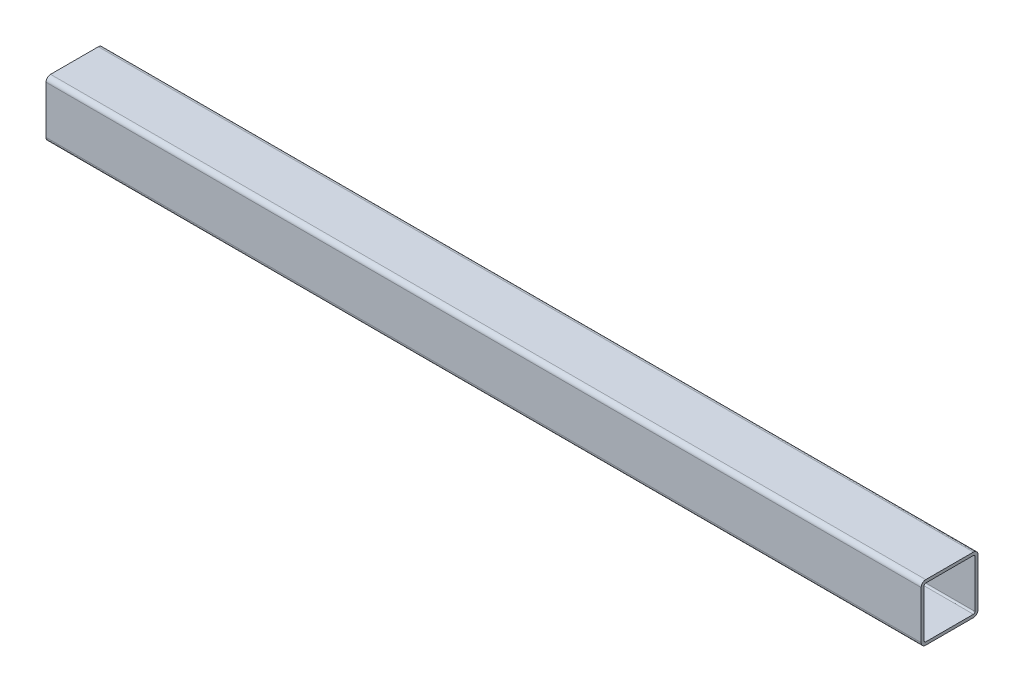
from build123d import *

# Parameters (mm, degrees)
BOSS_EXTRUDE1_DEPTH = 488.95


with BuildPart() as part:
    # Sketch1 → Boss-Extrude1 (new body)
    with BuildSketch(Plane(origin=(0, 0, 0), x_dir=(0, 0, -1), z_dir=(1, 0, 0))):
        with BuildLine():
            Line((0, 2.54), (0, 29.21))
            ThreePointArc((0, 29.21), (-0.743948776, 31.006051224), (-2.54, 31.75))
            Line((-2.54, 31.75), (-29.21, 31.75))
            ThreePointArc((-29.21, 31.75), (-31.006051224, 31.006051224), (-31.75, 29.21))
            Line((-31.75, 29.21), (-31.75, 2.54))
            ThreePointArc((-31.75, 2.54), (-31.006051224, 0.743948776), (-29.21, 0))
            Line((-29.21, 0), (-2.54, 0))
            ThreePointArc((-2.54, 0), (-0.743948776, 0.743948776), (0, 2.54))
        make_face()
        with BuildLine():
            Line((-1.651, 2.54), (-1.651, 29.21))
            ThreePointArc((-1.651, 29.21), (-1.911382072, 29.838617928), (-2.54, 30.099))
            Line((-2.54, 30.099), (-29.21, 30.099))
            ThreePointArc((-29.21, 30.099), (-29.838617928, 29.838617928), (-30.099, 29.21))
            Line((-30.099, 29.21), (-30.099, 2.54))
            ThreePointArc((-30.099, 2.54), (-29.838617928, 1.911382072), (-29.21, 1.651))
            Line((-29.21, 1.651), (-2.54, 1.651))
            ThreePointArc((-2.54, 1.651), (-1.911382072, 1.911382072), (-1.651, 2.54))
        make_face(mode=Mode.SUBTRACT)
    extrude(amount=BOSS_EXTRUDE1_DEPTH)


solid = part.part
